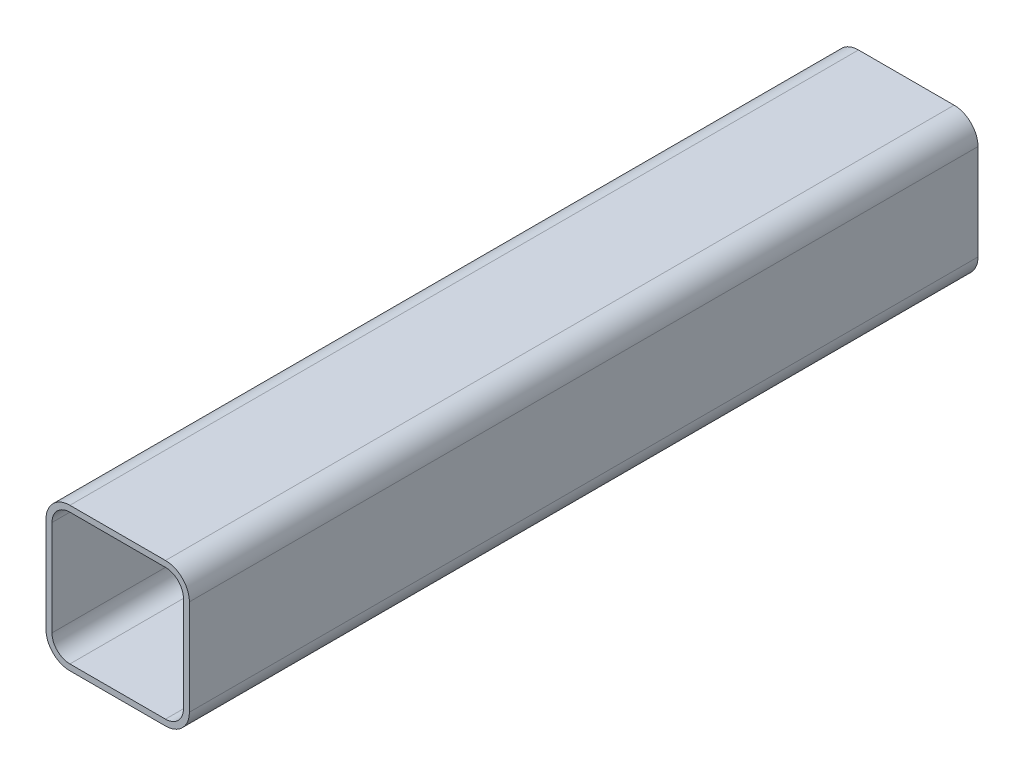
from build123d import *

# Parameters (mm, degrees)
BASE_EXTRUDE_THIN_DEPTH = 419.1


with BuildPart() as part:
    # Sketch1 → Base-Extrude-Thin (new body)
    with BuildSketch(Plane.XY):
        with BuildLine():
            Line((-25.4, 38.1), (25.4, 38.1))
            ThreePointArc((25.4, 38.1), (34.380256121, 34.380256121), (38.1, 25.4))
            Line((38.1, 25.4), (38.1, -25.4))
            ThreePointArc((38.1, -25.4), (34.380256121, -34.380256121), (25.4, -38.1))
            Line((25.4, -38.1), (-25.4, -38.1))
            ThreePointArc((-25.4, -38.1), (-34.380256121, -34.380256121), (-38.1, -25.4))
            Line((-38.1, -25.4), (-38.1, 25.4))
            ThreePointArc((-38.1, 25.4), (-34.380256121, 34.380256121), (-25.4, 38.1))
        make_face()
        with BuildLine():
            Line((-25.4, 34.925), (25.4, 34.925))
            ThreePointArc((25.4, 34.925), (32.135192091, 32.135192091), (34.925, 25.4))
            Line((34.925, 25.4), (34.925, -25.4))
            ThreePointArc((34.925, -25.4), (32.135192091, -32.135192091), (25.4, -34.925))
            Line((25.4, -34.925), (-25.4, -34.925))
            ThreePointArc((-25.4, -34.925), (-32.135192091, -32.135192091), (-34.925, -25.4))
            Line((-34.925, -25.4), (-34.925, 25.4))
            ThreePointArc((-34.925, 25.4), (-32.135192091, 32.135192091), (-25.4, 34.925))
        make_face(mode=Mode.SUBTRACT)
    extrude(amount=BASE_EXTRUDE_THIN_DEPTH)


solid = part.part
